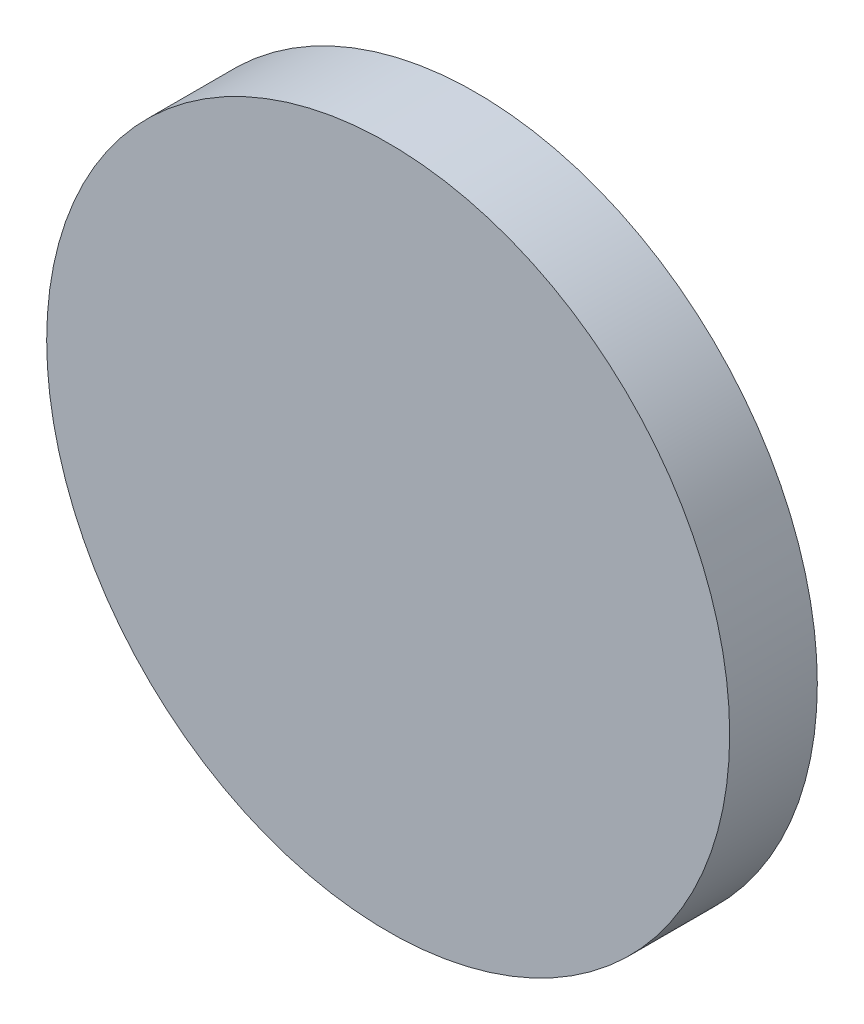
from build123d import *

# Parameters (mm, degrees)
SKETCH1_R      = 9.897415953
EXTRUDE1_DEPTH = 2.54


with BuildPart() as part:
    # Sketch1 → Extrude1 (new body)
    with BuildSketch(Plane.XY):
        Circle(SKETCH1_R)
    extrude(amount=EXTRUDE1_DEPTH)


solid = part.part
